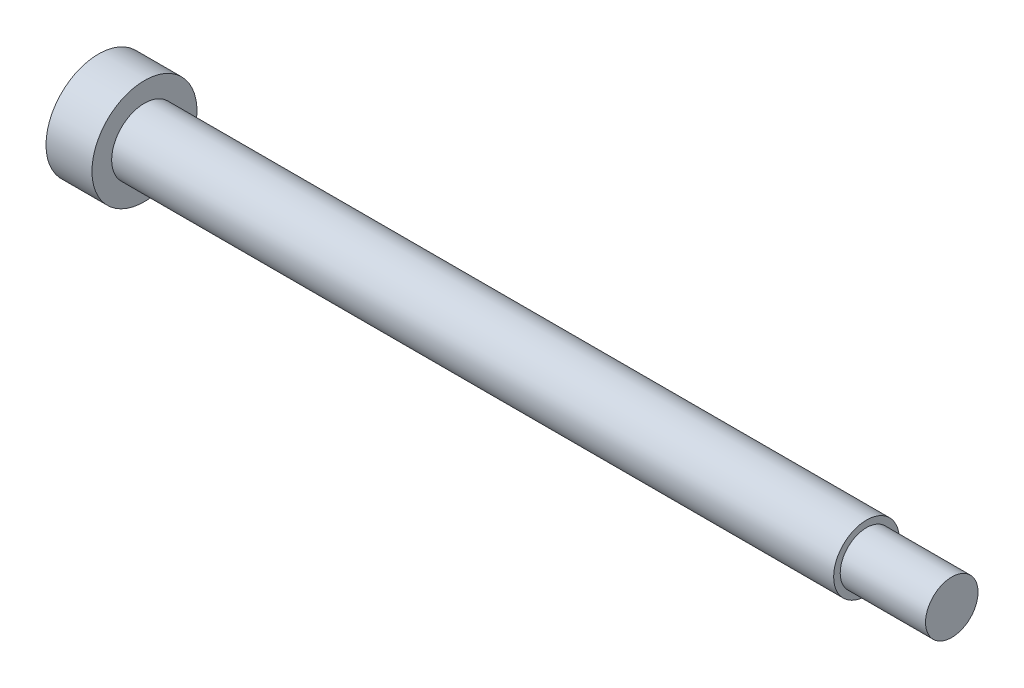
ISO-10303-21;
HEADER;
FILE_DESCRIPTION(('STEP AP214'),'2;1');
FILE_NAME('part.step','',(''),(''),'','','');
FILE_SCHEMA(('AUTOMOTIVE_DESIGN { 1 0 10303 214 1 1 1 1 }'));
ENDSEC;
DATA;
#1=APPLICATION_CONTEXT('core data for automotive mechanical design processes');
#2=APPLICATION_PROTOCOL_DEFINITION('international standard','automotive_design',2000,#1);
#3=PRODUCT_CONTEXT('',#1,'mechanical');
#4=PRODUCT('Part','Part','',(#3));
#5=PRODUCT_RELATED_PRODUCT_CATEGORY('part','',(#4));
#6=PRODUCT_DEFINITION_FORMATION('','',#4);
#7=PRODUCT_DEFINITION_CONTEXT('part definition',#1,'design');
#8=PRODUCT_DEFINITION('design','',#6,#7);
#9=PRODUCT_DEFINITION_SHAPE('','',#8);
#10=(LENGTH_UNIT() NAMED_UNIT(*) SI_UNIT(.MILLI.,.METRE.));
#11=(NAMED_UNIT(*) PLANE_ANGLE_UNIT() SI_UNIT($,.RADIAN.));
#12=(NAMED_UNIT(*) SI_UNIT($,.STERADIAN.) SOLID_ANGLE_UNIT());
#13=UNCERTAINTY_MEASURE_WITH_UNIT(LENGTH_MEASURE(1.E-05),#10,'distance_accuracy_value','');
#14=(GEOMETRIC_REPRESENTATION_CONTEXT(3) GLOBAL_UNCERTAINTY_ASSIGNED_CONTEXT((#13)) GLOBAL_UNIT_ASSIGNED_CONTEXT((#10,
#11,#12)) REPRESENTATION_CONTEXT('',''));
#15=CARTESIAN_POINT('',(0.,0.,0.));
#16=DIRECTION('',(0.,0.,1.));
#17=DIRECTION('',(1.,0.,0.));
#18=AXIS2_PLACEMENT_3D('',#15,#16,#17);
#19=CARTESIAN_POINT('',(0.,0.,0.));
#20=DIRECTION('',(1.,0.,0.));
#21=DIRECTION('',(0.,0.,-1.));
#22=AXIS2_PLACEMENT_3D('',#19,#20,#21);
#23=PLANE('',#22);
#24=DIRECTION('',(0.,0.866025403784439,-0.5));
#25=VECTOR('',#24,1.);
#26=CARTESIAN_POINT('',(0.,0.,2.5));
#27=LINE('',#26,#25);
#28=CARTESIAN_POINT('',(0.,0.,2.5));
#29=VERTEX_POINT('',#28);
#30=CARTESIAN_POINT('',(0.,2.1650635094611,1.25));
#31=VERTEX_POINT('',#30);
#32=EDGE_CURVE('E104',#29,#31,#27,.T.);
#33=ORIENTED_EDGE('',*,*,#32,.F.);
#34=DIRECTION('',(0.,0.866025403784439,0.5));
#35=VECTOR('',#34,1.);
#36=CARTESIAN_POINT('',(0.,-2.1650635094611,1.25));
#37=LINE('',#36,#35);
#38=CARTESIAN_POINT('',(0.,-2.1650635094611,1.25));
#39=VERTEX_POINT('',#38);
#40=EDGE_CURVE('E30',#39,#29,#37,.T.);
#41=ORIENTED_EDGE('',*,*,#40,.F.);
#42=DIRECTION('',(0.,0.,1.));
#43=VECTOR('',#42,1.);
#44=CARTESIAN_POINT('',(0.,-2.1650635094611,-1.25));
#45=LINE('',#44,#43);
#46=CARTESIAN_POINT('',(0.,-2.1650635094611,-1.25));
#47=VERTEX_POINT('',#46);
#48=EDGE_CURVE('E113',#47,#39,#45,.T.);
#49=ORIENTED_EDGE('',*,*,#48,.F.);
#50=DIRECTION('',(0.,-0.866025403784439,0.5));
#51=VECTOR('',#50,1.);
#52=CARTESIAN_POINT('',(0.,0.,-2.5));
#53=LINE('',#52,#51);
#54=CARTESIAN_POINT('',(0.,0.,-2.5));
#55=VERTEX_POINT('',#54);
#56=EDGE_CURVE('E111',#55,#47,#53,.T.);
#57=ORIENTED_EDGE('',*,*,#56,.F.);
#58=DIRECTION('',(0.,-0.866025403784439,-0.5));
#59=VECTOR('',#58,1.);
#60=CARTESIAN_POINT('',(0.,2.1650635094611,-1.25));
#61=LINE('',#60,#59);
#62=CARTESIAN_POINT('',(0.,2.1650635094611,-1.25));
#63=VERTEX_POINT('',#62);
#64=EDGE_CURVE('E78',#63,#55,#61,.T.);
#65=ORIENTED_EDGE('',*,*,#64,.F.);
#66=DIRECTION('',(0.,0.,-1.));
#67=VECTOR('',#66,1.);
#68=CARTESIAN_POINT('',(0.,2.1650635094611,1.25));
#69=LINE('',#68,#67);
#70=EDGE_CURVE('E107',#31,#63,#69,.T.);
#71=ORIENTED_EDGE('',*,*,#70,.F.);
#72=EDGE_LOOP('',(#33,#41,#49,#57,#65,#71));
#73=FACE_BOUND('',#72,.T.);
#74=CARTESIAN_POINT('',(0.,0.,0.));
#75=DIRECTION('',(-1.,0.,0.));
#76=DIRECTION('',(0.,0.,1.));
#77=AXIS2_PLACEMENT_3D('',#74,#75,#76);
#78=CIRCLE('',#77,8.);
#79=CARTESIAN_POINT('',(0.,0.,8.));
#80=VERTEX_POINT('',#79);
#81=EDGE_CURVE('E10',#80,#80,#78,.T.);
#82=ORIENTED_EDGE('',*,*,#81,.T.);
#83=EDGE_LOOP('',(#82));
#84=FACE_BOUND('',#83,.T.);
#85=ADVANCED_FACE('F16',(#73,#84),#23,.F.);
#86=CARTESIAN_POINT('',(0.,0.,0.));
#87=DIRECTION('',(-1.,0.,0.));
#88=DIRECTION('',(0.,0.,1.));
#89=AXIS2_PLACEMENT_3D('',#86,#87,#88);
#90=CYLINDRICAL_SURFACE('',#89,8.);
#91=ORIENTED_EDGE('',*,*,#81,.F.);
#92=EDGE_LOOP('',(#91));
#93=FACE_BOUND('',#92,.T.);
#94=CARTESIAN_POINT('',(7.,0.,0.));
#95=DIRECTION('',(-1.,0.,0.));
#96=DIRECTION('',(0.,0.,1.));
#97=AXIS2_PLACEMENT_3D('',#94,#95,#96);
#98=CIRCLE('',#97,8.);
#99=CARTESIAN_POINT('',(7.,0.,8.));
#100=VERTEX_POINT('',#99);
#101=EDGE_CURVE('E23',#100,#100,#98,.T.);
#102=ORIENTED_EDGE('',*,*,#101,.T.);
#103=EDGE_LOOP('',(#102));
#104=FACE_BOUND('',#103,.T.);
#105=ADVANCED_FACE('F136',(#93,#104),#90,.T.);
#106=CARTESIAN_POINT('',(7.,8.,0.));
#107=DIRECTION('',(-1.,0.,0.));
#108=DIRECTION('',(0.,0.,1.));
#109=AXIS2_PLACEMENT_3D('',#106,#107,#108);
#110=PLANE('',#109);
#111=ORIENTED_EDGE('',*,*,#101,.F.);
#112=EDGE_LOOP('',(#111));
#113=FACE_BOUND('',#112,.T.);
#114=CARTESIAN_POINT('',(7.,0.,0.));
#115=DIRECTION('',(-1.,0.,0.));
#116=DIRECTION('',(0.,0.,1.));
#117=AXIS2_PLACEMENT_3D('',#114,#115,#116);
#118=CIRCLE('',#117,5.);
#119=CARTESIAN_POINT('',(7.,0.,5.));
#120=VERTEX_POINT('',#119);
#121=EDGE_CURVE('E131',#120,#120,#118,.T.);
#122=ORIENTED_EDGE('',*,*,#121,.T.);
#123=EDGE_LOOP('',(#122));
#124=FACE_BOUND('',#123,.T.);
#125=ADVANCED_FACE('F138',(#113,#124),#110,.F.);
#126=CARTESIAN_POINT('',(0.,0.,0.));
#127=DIRECTION('',(-1.,0.,0.));
#128=DIRECTION('',(0.,0.,1.));
#129=AXIS2_PLACEMENT_3D('',#126,#127,#128);
#130=CYLINDRICAL_SURFACE('',#129,5.);
#131=ORIENTED_EDGE('',*,*,#121,.F.);
#132=EDGE_LOOP('',(#131));
#133=FACE_BOUND('',#132,.T.);
#134=CARTESIAN_POINT('',(117.,0.,0.));
#135=DIRECTION('',(-1.,0.,0.));
#136=DIRECTION('',(0.,0.,1.));
#137=AXIS2_PLACEMENT_3D('',#134,#135,#136);
#138=CIRCLE('',#137,5.);
#139=CARTESIAN_POINT('',(117.,0.,5.));
#140=VERTEX_POINT('',#139);
#141=EDGE_CURVE('E128',#140,#140,#138,.T.);
#142=ORIENTED_EDGE('',*,*,#141,.T.);
#143=EDGE_LOOP('',(#142));
#144=FACE_BOUND('',#143,.T.);
#145=ADVANCED_FACE('F141',(#133,#144),#130,.T.);
#146=CARTESIAN_POINT('',(117.,5.,0.));
#147=DIRECTION('',(-1.,0.,0.));
#148=DIRECTION('',(0.,0.,1.));
#149=AXIS2_PLACEMENT_3D('',#146,#147,#148);
#150=PLANE('',#149);
#151=ORIENTED_EDGE('',*,*,#141,.F.);
#152=EDGE_LOOP('',(#151));
#153=FACE_BOUND('',#152,.T.);
#154=CARTESIAN_POINT('',(117.,0.,0.));
#155=DIRECTION('',(-1.,0.,0.));
#156=DIRECTION('',(0.,0.,1.));
#157=AXIS2_PLACEMENT_3D('',#154,#155,#156);
#158=CIRCLE('',#157,4.);
#159=CARTESIAN_POINT('',(117.,0.,4.));
#160=VERTEX_POINT('',#159);
#161=EDGE_CURVE('E125',#160,#160,#158,.T.);
#162=ORIENTED_EDGE('',*,*,#161,.T.);
#163=EDGE_LOOP('',(#162));
#164=FACE_BOUND('',#163,.T.);
#165=ADVANCED_FACE('F147',(#153,#164),#150,.F.);
#166=CARTESIAN_POINT('',(0.,0.,0.));
#167=DIRECTION('',(-1.,0.,0.));
#168=DIRECTION('',(0.,0.,1.));
#169=AXIS2_PLACEMENT_3D('',#166,#167,#168);
#170=CYLINDRICAL_SURFACE('',#169,4.);
#171=ORIENTED_EDGE('',*,*,#161,.F.);
#172=EDGE_LOOP('',(#171));
#173=FACE_BOUND('',#172,.T.);
#174=CARTESIAN_POINT('',(130.,0.,0.));
#175=DIRECTION('',(-1.,0.,0.));
#176=DIRECTION('',(0.,0.,1.));
#177=AXIS2_PLACEMENT_3D('',#174,#175,#176);
#178=CIRCLE('',#177,4.);
#179=CARTESIAN_POINT('',(130.,0.,4.));
#180=VERTEX_POINT('',#179);
#181=EDGE_CURVE('E117',#180,#180,#178,.T.);
#182=ORIENTED_EDGE('',*,*,#181,.T.);
#183=EDGE_LOOP('',(#182));
#184=FACE_BOUND('',#183,.T.);
#185=ADVANCED_FACE('F153',(#173,#184),#170,.T.);
#186=CARTESIAN_POINT('',(130.,4.,0.));
#187=DIRECTION('',(-1.,0.,0.));
#188=DIRECTION('',(0.,0.,1.));
#189=AXIS2_PLACEMENT_3D('',#186,#187,#188);
#190=PLANE('',#189);
#191=ORIENTED_EDGE('',*,*,#181,.F.);
#192=EDGE_LOOP('',(#191));
#193=FACE_BOUND('',#192,.T.);
#194=ADVANCED_FACE('F159',(#193),#190,.F.);
#195=CARTESIAN_POINT('',(5.,-2.1650635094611,1.25));
#196=DIRECTION('',(0.,-0.5,0.866025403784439));
#197=DIRECTION('',(0.,-0.866025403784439,-0.5));
#198=AXIS2_PLACEMENT_3D('',#195,#196,#197);
#199=PLANE('',#198);
#200=ORIENTED_EDGE('',*,*,#40,.T.);
#201=DIRECTION('',(-1.,0.,0.));
#202=VECTOR('',#201,1.);
#203=CARTESIAN_POINT('',(5.,0.,2.5));
#204=LINE('',#203,#202);
#205=CARTESIAN_POINT('',(5.,0.,2.5));
#206=VERTEX_POINT('',#205);
#207=EDGE_CURVE('E60',#206,#29,#204,.T.);
#208=ORIENTED_EDGE('',*,*,#207,.F.);
#209=DIRECTION('',(0.,0.866025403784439,0.5));
#210=VECTOR('',#209,1.);
#211=CARTESIAN_POINT('',(5.,-2.1650635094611,1.25));
#212=LINE('',#211,#210);
#213=CARTESIAN_POINT('',(5.,-2.1650635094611,1.25));
#214=VERTEX_POINT('',#213);
#215=EDGE_CURVE('E115',#214,#206,#212,.T.);
#216=ORIENTED_EDGE('',*,*,#215,.F.);
#217=DIRECTION('',(-1.,0.,0.));
#218=VECTOR('',#217,1.);
#219=CARTESIAN_POINT('',(5.,-2.1650635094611,1.25));
#220=LINE('',#219,#218);
#221=EDGE_CURVE('E38',#214,#39,#220,.T.);
#222=ORIENTED_EDGE('',*,*,#221,.T.);
#223=EDGE_LOOP('',(#200,#208,#216,#222));
#224=FACE_BOUND('',#223,.T.);
#225=ADVANCED_FACE('F164',(#224),#199,.F.);
#226=CARTESIAN_POINT('',(5.,-2.1650635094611,-1.25));
#227=DIRECTION('',(0.,-1.,0.));
#228=DIRECTION('',(0.,0.,-1.));
#229=AXIS2_PLACEMENT_3D('',#226,#227,#228);
#230=PLANE('',#229);
#231=ORIENTED_EDGE('',*,*,#48,.T.);
#232=ORIENTED_EDGE('',*,*,#221,.F.);
#233=DIRECTION('',(0.,0.,1.));
#234=VECTOR('',#233,1.);
#235=CARTESIAN_POINT('',(5.,-2.1650635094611,-1.25));
#236=LINE('',#235,#234);
#237=CARTESIAN_POINT('',(5.,-2.1650635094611,-1.25));
#238=VERTEX_POINT('',#237);
#239=EDGE_CURVE('E90',#238,#214,#236,.T.);
#240=ORIENTED_EDGE('',*,*,#239,.F.);
#241=DIRECTION('',(-1.,0.,0.));
#242=VECTOR('',#241,1.);
#243=CARTESIAN_POINT('',(5.,-2.1650635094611,-1.25));
#244=LINE('',#243,#242);
#245=EDGE_CURVE('E82',#238,#47,#244,.T.);
#246=ORIENTED_EDGE('',*,*,#245,.T.);
#247=EDGE_LOOP('',(#231,#232,#240,#246));
#248=FACE_BOUND('',#247,.T.);
#249=ADVANCED_FACE('F171',(#248),#230,.F.);
#250=CARTESIAN_POINT('',(5.,0.,-2.5));
#251=DIRECTION('',(0.,-0.5,-0.866025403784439));
#252=DIRECTION('',(0.,0.866025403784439,-0.5));
#253=AXIS2_PLACEMENT_3D('',#250,#251,#252);
#254=PLANE('',#253);
#255=ORIENTED_EDGE('',*,*,#56,.T.);
#256=ORIENTED_EDGE('',*,*,#245,.F.);
#257=DIRECTION('',(0.,-0.866025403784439,0.5));
#258=VECTOR('',#257,1.);
#259=CARTESIAN_POINT('',(5.,0.,-2.5));
#260=LINE('',#259,#258);
#261=CARTESIAN_POINT('',(5.,0.,-2.5));
#262=VERTEX_POINT('',#261);
#263=EDGE_CURVE('E86',#262,#238,#260,.T.);
#264=ORIENTED_EDGE('',*,*,#263,.F.);
#265=DIRECTION('',(-1.,0.,0.));
#266=VECTOR('',#265,1.);
#267=CARTESIAN_POINT('',(5.,0.,-2.5));
#268=LINE('',#267,#266);
#269=EDGE_CURVE('E71',#262,#55,#268,.T.);
#270=ORIENTED_EDGE('',*,*,#269,.T.);
#271=EDGE_LOOP('',(#255,#256,#264,#270));
#272=FACE_BOUND('',#271,.T.);
#273=ADVANCED_FACE('F87',(#272),#254,.F.);
#274=CARTESIAN_POINT('',(5.,2.1650635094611,-1.25));
#275=DIRECTION('',(0.,0.5,-0.866025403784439));
#276=DIRECTION('',(0.,0.866025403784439,0.5));
#277=AXIS2_PLACEMENT_3D('',#274,#275,#276);
#278=PLANE('',#277);
#279=ORIENTED_EDGE('',*,*,#64,.T.);
#280=ORIENTED_EDGE('',*,*,#269,.F.);
#281=DIRECTION('',(0.,-0.866025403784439,-0.5));
#282=VECTOR('',#281,1.);
#283=CARTESIAN_POINT('',(5.,2.1650635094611,-1.25));
#284=LINE('',#283,#282);
#285=CARTESIAN_POINT('',(5.,2.1650635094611,-1.25));
#286=VERTEX_POINT('',#285);
#287=EDGE_CURVE('E75',#286,#262,#284,.T.);
#288=ORIENTED_EDGE('',*,*,#287,.F.);
#289=DIRECTION('',(-1.,0.,0.));
#290=VECTOR('',#289,1.);
#291=CARTESIAN_POINT('',(5.,2.1650635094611,-1.25));
#292=LINE('',#291,#290);
#293=EDGE_CURVE('E83',#286,#63,#292,.T.);
#294=ORIENTED_EDGE('',*,*,#293,.T.);
#295=EDGE_LOOP('',(#279,#280,#288,#294));
#296=FACE_BOUND('',#295,.T.);
#297=ADVANCED_FACE('F73',(#296),#278,.F.);
#298=CARTESIAN_POINT('',(5.,2.1650635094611,1.25));
#299=DIRECTION('',(0.,1.,0.));
#300=DIRECTION('',(0.,0.,1.));
#301=AXIS2_PLACEMENT_3D('',#298,#299,#300);
#302=PLANE('',#301);
#303=ORIENTED_EDGE('',*,*,#70,.T.);
#304=ORIENTED_EDGE('',*,*,#293,.F.);
#305=DIRECTION('',(0.,0.,-1.));
#306=VECTOR('',#305,1.);
#307=CARTESIAN_POINT('',(5.,2.1650635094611,1.25));
#308=LINE('',#307,#306);
#309=CARTESIAN_POINT('',(5.,2.1650635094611,1.25));
#310=VERTEX_POINT('',#309);
#311=EDGE_CURVE('E96',#310,#286,#308,.T.);
#312=ORIENTED_EDGE('',*,*,#311,.F.);
#313=DIRECTION('',(-1.,0.,0.));
#314=VECTOR('',#313,1.);
#315=CARTESIAN_POINT('',(5.,2.1650635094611,1.25));
#316=LINE('',#315,#314);
#317=EDGE_CURVE('E120',#310,#31,#316,.T.);
#318=ORIENTED_EDGE('',*,*,#317,.T.);
#319=EDGE_LOOP('',(#303,#304,#312,#318));
#320=FACE_BOUND('',#319,.T.);
#321=ADVANCED_FACE('F199',(#320),#302,.F.);
#322=CARTESIAN_POINT('',(5.,0.,2.5));
#323=DIRECTION('',(0.,0.5,0.866025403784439));
#324=DIRECTION('',(0.,-0.866025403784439,0.5));
#325=AXIS2_PLACEMENT_3D('',#322,#323,#324);
#326=PLANE('',#325);
#327=ORIENTED_EDGE('',*,*,#32,.T.);
#328=ORIENTED_EDGE('',*,*,#317,.F.);
#329=DIRECTION('',(0.,0.866025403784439,-0.5));
#330=VECTOR('',#329,1.);
#331=CARTESIAN_POINT('',(5.,0.,2.5));
#332=LINE('',#331,#330);
#333=EDGE_CURVE('E98',#206,#310,#332,.T.);
#334=ORIENTED_EDGE('',*,*,#333,.F.);
#335=ORIENTED_EDGE('',*,*,#207,.T.);
#336=EDGE_LOOP('',(#327,#328,#334,#335));
#337=FACE_BOUND('',#336,.T.);
#338=ADVANCED_FACE('F186',(#337),#326,.F.);
#339=CARTESIAN_POINT('',(5.,0.,0.));
#340=DIRECTION('',(-1.,0.,0.));
#341=DIRECTION('',(0.,0.,1.));
#342=AXIS2_PLACEMENT_3D('',#339,#340,#341);
#343=PLANE('',#342);
#344=ORIENTED_EDGE('',*,*,#215,.T.);
#345=ORIENTED_EDGE('',*,*,#333,.T.);
#346=ORIENTED_EDGE('',*,*,#311,.T.);
#347=ORIENTED_EDGE('',*,*,#287,.T.);
#348=ORIENTED_EDGE('',*,*,#263,.T.);
#349=ORIENTED_EDGE('',*,*,#239,.T.);
#350=EDGE_LOOP('',(#344,#345,#346,#347,#348,#349));
#351=FACE_BOUND('',#350,.T.);
#352=ADVANCED_FACE('F93',(#351),#343,.T.);
#353=CLOSED_SHELL('',(#85,#105,#125,#145,#165,#185,#194,#225,#249,#273,#297,#321,#338,#352));
#354=MANIFOLD_SOLID_BREP('B1',#353);
#355=ADVANCED_BREP_SHAPE_REPRESENTATION('',(#18,#354),#14);
#356=SHAPE_DEFINITION_REPRESENTATION(#9,#355);
ENDSEC;
END-ISO-10303-21;
